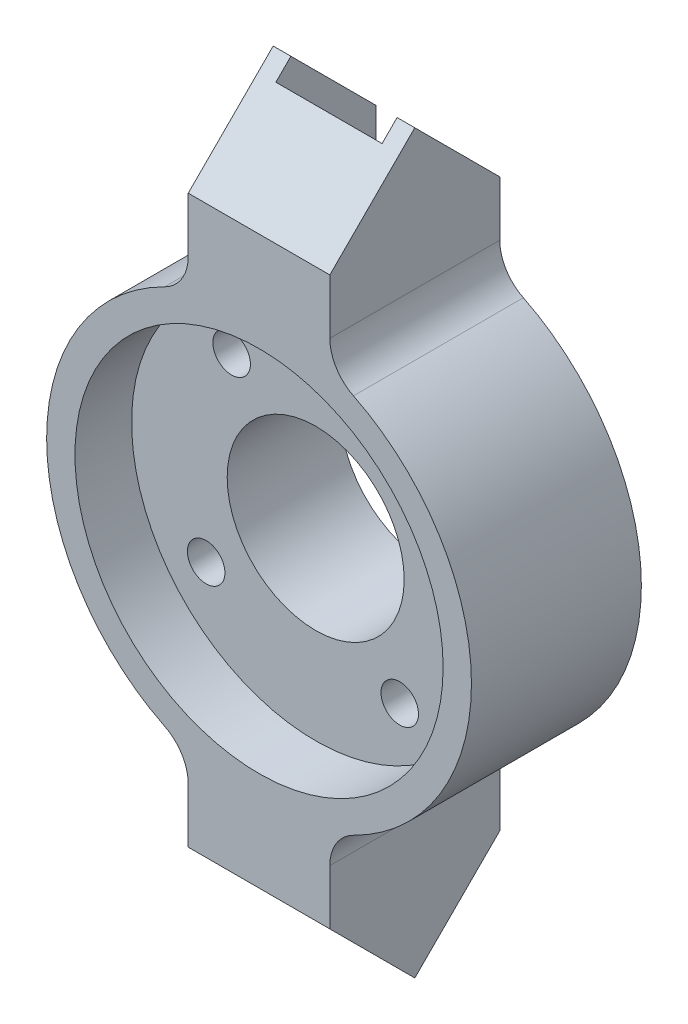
ISO-10303-21;
HEADER;
FILE_DESCRIPTION(('STEP AP214'),'2;1');
FILE_NAME('part.step','',(''),(''),'','','');
FILE_SCHEMA(('AUTOMOTIVE_DESIGN { 1 0 10303 214 1 1 1 1 }'));
ENDSEC;
DATA;
#1=APPLICATION_CONTEXT('core data for automotive mechanical design processes');
#2=APPLICATION_PROTOCOL_DEFINITION('international standard','automotive_design',2000,#1);
#3=PRODUCT_CONTEXT('',#1,'mechanical');
#4=PRODUCT('Part','Part','',(#3));
#5=PRODUCT_RELATED_PRODUCT_CATEGORY('part','',(#4));
#6=PRODUCT_DEFINITION_FORMATION('','',#4);
#7=PRODUCT_DEFINITION_CONTEXT('part definition',#1,'design');
#8=PRODUCT_DEFINITION('design','',#6,#7);
#9=PRODUCT_DEFINITION_SHAPE('','',#8);
#10=(LENGTH_UNIT() NAMED_UNIT(*) SI_UNIT(.MILLI.,.METRE.));
#11=(NAMED_UNIT(*) PLANE_ANGLE_UNIT() SI_UNIT($,.RADIAN.));
#12=(NAMED_UNIT(*) SI_UNIT($,.STERADIAN.) SOLID_ANGLE_UNIT());
#13=UNCERTAINTY_MEASURE_WITH_UNIT(LENGTH_MEASURE(1.E-05),#10,'distance_accuracy_value','');
#14=(GEOMETRIC_REPRESENTATION_CONTEXT(3) GLOBAL_UNCERTAINTY_ASSIGNED_CONTEXT((#13)) GLOBAL_UNIT_ASSIGNED_CONTEXT((#10,
#11,#12)) REPRESENTATION_CONTEXT('',''));
#15=CARTESIAN_POINT('',(0.,0.,0.));
#16=DIRECTION('',(0.,0.,1.));
#17=DIRECTION('',(1.,0.,0.));
#18=AXIS2_PLACEMENT_3D('',#15,#16,#17);
#19=CARTESIAN_POINT('',(0.,-40.,1.5));
#20=DIRECTION('',(0.,0.707106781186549,0.707106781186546));
#21=DIRECTION('',(0.,-0.707106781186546,0.707106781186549));
#22=AXIS2_PLACEMENT_3D('',#19,#20,#21);
#23=PLANE('',#22);
#24=DIRECTION('',(0.,-0.707106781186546,0.707106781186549));
#25=VECTOR('',#24,1.);
#26=CARTESIAN_POINT('',(-7.5,-40.,1.5));
#27=LINE('',#26,#25);
#28=CARTESIAN_POINT('',(-7.5,-51.9999999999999,13.4999999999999));
#29=VERTEX_POINT('',#28);
#30=CARTESIAN_POINT('',(-7.5,-40.,1.50000000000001));
#31=VERTEX_POINT('',#30);
#32=EDGE_CURVE('E401',#29,#31,#27,.F.);
#33=ORIENTED_EDGE('',*,*,#32,.F.);
#34=DIRECTION('',(-1.,0.,0.));
#35=VECTOR('',#34,1.);
#36=CARTESIAN_POINT('',(0.,-51.9999999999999,13.4999999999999));
#37=LINE('',#36,#35);
#38=CARTESIAN_POINT('',(-10.,-51.9999999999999,13.4999999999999));
#39=VERTEX_POINT('',#38);
#40=EDGE_CURVE('E428',#29,#39,#37,.T.);
#41=ORIENTED_EDGE('',*,*,#40,.T.);
#42=DIRECTION('',(0.,0.707106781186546,-0.707106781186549));
#43=VECTOR('',#42,1.);
#44=CARTESIAN_POINT('',(-10.,-59.5,21.));
#45=LINE('',#44,#43);
#46=CARTESIAN_POINT('',(-10.,-40.,1.5));
#47=VERTEX_POINT('',#46);
#48=EDGE_CURVE('E389',#47,#39,#45,.F.);
#49=ORIENTED_EDGE('',*,*,#48,.F.);
#50=DIRECTION('',(-1.,0.,0.));
#51=VECTOR('',#50,1.);
#52=CARTESIAN_POINT('',(0.,-40.,1.5));
#53=LINE('',#52,#51);
#54=EDGE_CURVE('E385',#31,#47,#53,.T.);
#55=ORIENTED_EDGE('',*,*,#54,.F.);
#56=EDGE_LOOP('',(#33,#41,#49,#55));
#57=FACE_BOUND('',#56,.T.);
#58=ADVANCED_FACE('F38',(#57),#23,.F.);
#59=CARTESIAN_POINT('',(0.,40.,1.5));
#60=DIRECTION('',(0.,-0.707106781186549,0.707106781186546));
#61=DIRECTION('',(0.,-0.707106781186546,-0.707106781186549));
#62=AXIS2_PLACEMENT_3D('',#59,#60,#61);
#63=PLANE('',#62);
#64=DIRECTION('',(0.,0.707106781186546,0.707106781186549));
#65=VECTOR('',#64,1.);
#66=CARTESIAN_POINT('',(7.5,40.,1.5));
#67=LINE('',#66,#65);
#68=CARTESIAN_POINT('',(7.5,51.9999999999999,13.4999999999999));
#69=VERTEX_POINT('',#68);
#70=CARTESIAN_POINT('',(7.5,40.,1.50000000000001));
#71=VERTEX_POINT('',#70);
#72=EDGE_CURVE('E396',#69,#71,#67,.F.);
#73=ORIENTED_EDGE('',*,*,#72,.F.);
#74=DIRECTION('',(1.,0.,0.));
#75=VECTOR('',#74,1.);
#76=CARTESIAN_POINT('',(0.,51.9999999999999,13.4999999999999));
#77=LINE('',#76,#75);
#78=CARTESIAN_POINT('',(10.,51.9999999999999,13.4999999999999));
#79=VERTEX_POINT('',#78);
#80=EDGE_CURVE('E411',#69,#79,#77,.T.);
#81=ORIENTED_EDGE('',*,*,#80,.T.);
#82=DIRECTION('',(0.,-0.707106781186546,-0.707106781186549));
#83=VECTOR('',#82,1.);
#84=CARTESIAN_POINT('',(10.,46.142135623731,7.642135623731));
#85=LINE('',#84,#83);
#86=CARTESIAN_POINT('',(10.,40.,1.5));
#87=VERTEX_POINT('',#86);
#88=EDGE_CURVE('E380',#87,#79,#85,.F.);
#89=ORIENTED_EDGE('',*,*,#88,.F.);
#90=DIRECTION('',(1.,0.,0.));
#91=VECTOR('',#90,1.);
#92=CARTESIAN_POINT('',(0.,40.,1.5));
#93=LINE('',#92,#91);
#94=EDGE_CURVE('E376',#71,#87,#93,.T.);
#95=ORIENTED_EDGE('',*,*,#94,.F.);
#96=EDGE_LOOP('',(#73,#81,#89,#95));
#97=FACE_BOUND('',#96,.T.);
#98=ADVANCED_FACE('F447',(#97),#63,.F.);
#99=CARTESIAN_POINT('',(0.,0.,25.5));
#100=DIRECTION('',(0.,0.,1.));
#101=DIRECTION('',(1.,0.,0.));
#102=AXIS2_PLACEMENT_3D('',#99,#100,#101);
#103=PLANE('',#102);
#104=CARTESIAN_POINT('',(0.,0.,25.5));
#105=DIRECTION('',(0.,0.,1.));
#106=DIRECTION('',(1.,0.,0.));
#107=AXIS2_PLACEMENT_3D('',#104,#105,#106);
#108=CIRCLE('',#107,26.);
#109=CARTESIAN_POINT('',(26.,0.,25.5));
#110=VERTEX_POINT('',#109);
#111=EDGE_CURVE('E312',#110,#110,#108,.T.);
#112=ORIENTED_EDGE('',*,*,#111,.F.);
#113=EDGE_LOOP('',(#112));
#114=FACE_BOUND('',#113,.T.);
#115=DIRECTION('',(0.,1.,0.));
#116=VECTOR('',#115,1.);
#117=CARTESIAN_POINT('',(-10.,-55.,25.5));
#118=LINE('',#117,#116);
#119=CARTESIAN_POINT('',(-10.,-39.9999999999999,25.5));
#120=VERTEX_POINT('',#119);
#121=CARTESIAN_POINT('',(-10.,-32.2490309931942,25.5));
#122=VERTEX_POINT('',#121);
#123=EDGE_CURVE('E251',#120,#122,#118,.T.);
#124=ORIENTED_EDGE('',*,*,#123,.F.);
#125=DIRECTION('',(1.,0.,0.));
#126=VECTOR('',#125,1.);
#127=CARTESIAN_POINT('',(0.,-39.9999999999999,25.5));
#128=LINE('',#127,#126);
#129=CARTESIAN_POINT('',(10.,-39.9999999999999,25.5));
#130=VERTEX_POINT('',#129);
#131=EDGE_CURVE('E431',#120,#130,#128,.T.);
#132=ORIENTED_EDGE('',*,*,#131,.T.);
#133=DIRECTION('',(0.,-1.,0.));
#134=VECTOR('',#133,1.);
#135=CARTESIAN_POINT('',(10.,-28.2842712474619,25.5));
#136=LINE('',#135,#134);
#137=CARTESIAN_POINT('',(10.,-32.2490309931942,25.5));
#138=VERTEX_POINT('',#137);
#139=EDGE_CURVE('E247',#138,#130,#136,.T.);
#140=ORIENTED_EDGE('',*,*,#139,.F.);
#141=CARTESIAN_POINT('',(16.,-32.2490309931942,25.5));
#142=DIRECTION('',(0.,0.,1.));
#143=DIRECTION('',(1.,0.,0.));
#144=AXIS2_PLACEMENT_3D('',#141,#142,#143);
#145=CIRCLE('',#144,6.);
#146=CARTESIAN_POINT('',(13.3333333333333,-26.8741924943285,25.5));
#147=VERTEX_POINT('',#146);
#148=EDGE_CURVE('E360',#138,#147,#145,.F.);
#149=ORIENTED_EDGE('',*,*,#148,.T.);
#150=CARTESIAN_POINT('',(0.,0.,25.5));
#151=DIRECTION('',(0.,0.,-1.));
#152=DIRECTION('',(-1.,0.,0.));
#153=AXIS2_PLACEMENT_3D('',#150,#151,#152);
#154=CIRCLE('',#153,30.);
#155=CARTESIAN_POINT('',(13.3333333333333,26.8741924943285,25.5));
#156=VERTEX_POINT('',#155);
#157=EDGE_CURVE('E244',#156,#147,#154,.T.);
#158=ORIENTED_EDGE('',*,*,#157,.F.);
#159=CARTESIAN_POINT('',(16.,32.2490309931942,25.5));
#160=DIRECTION('',(0.,0.,1.));
#161=DIRECTION('',(1.,0.,0.));
#162=AXIS2_PLACEMENT_3D('',#159,#160,#161);
#163=CIRCLE('',#162,6.);
#164=CARTESIAN_POINT('',(10.,32.2490309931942,25.5));
#165=VERTEX_POINT('',#164);
#166=EDGE_CURVE('E373',#156,#165,#163,.F.);
#167=ORIENTED_EDGE('',*,*,#166,.T.);
#168=DIRECTION('',(0.,-1.,0.));
#169=VECTOR('',#168,1.);
#170=CARTESIAN_POINT('',(10.,28.2842712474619,25.5));
#171=LINE('',#170,#169);
#172=CARTESIAN_POINT('',(10.,39.9999999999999,25.5));
#173=VERTEX_POINT('',#172);
#174=EDGE_CURVE('E259',#173,#165,#171,.T.);
#175=ORIENTED_EDGE('',*,*,#174,.F.);
#176=DIRECTION('',(-1.,0.,0.));
#177=VECTOR('',#176,1.);
#178=CARTESIAN_POINT('',(0.,39.9999999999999,25.5));
#179=LINE('',#178,#177);
#180=CARTESIAN_POINT('',(-10.,39.9999999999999,25.5));
#181=VERTEX_POINT('',#180);
#182=EDGE_CURVE('E415',#173,#181,#179,.T.);
#183=ORIENTED_EDGE('',*,*,#182,.T.);
#184=DIRECTION('',(0.,1.,0.));
#185=VECTOR('',#184,1.);
#186=CARTESIAN_POINT('',(-10.,55.,25.5));
#187=LINE('',#186,#185);
#188=CARTESIAN_POINT('',(-10.,32.2490309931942,25.5));
#189=VERTEX_POINT('',#188);
#190=EDGE_CURVE('E256',#189,#181,#187,.T.);
#191=ORIENTED_EDGE('',*,*,#190,.F.);
#192=CARTESIAN_POINT('',(-16.,32.2490309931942,25.5));
#193=DIRECTION('',(0.,0.,1.));
#194=DIRECTION('',(1.,0.,0.));
#195=AXIS2_PLACEMENT_3D('',#192,#193,#194);
#196=CIRCLE('',#195,6.);
#197=CARTESIAN_POINT('',(-13.3333333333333,26.8741924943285,25.5));
#198=VERTEX_POINT('',#197);
#199=EDGE_CURVE('E369',#189,#198,#196,.F.);
#200=ORIENTED_EDGE('',*,*,#199,.T.);
#201=CARTESIAN_POINT('',(0.,0.,25.5));
#202=DIRECTION('',(0.,0.,-1.));
#203=DIRECTION('',(-1.,0.,0.));
#204=AXIS2_PLACEMENT_3D('',#201,#202,#203);
#205=CIRCLE('',#204,30.);
#206=CARTESIAN_POINT('',(-13.3333333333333,-26.8741924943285,25.5));
#207=VERTEX_POINT('',#206);
#208=EDGE_CURVE('E253',#207,#198,#205,.T.);
#209=ORIENTED_EDGE('',*,*,#208,.F.);
#210=CARTESIAN_POINT('',(-16.,-32.2490309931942,25.5));
#211=DIRECTION('',(0.,0.,1.));
#212=DIRECTION('',(1.,0.,0.));
#213=AXIS2_PLACEMENT_3D('',#210,#211,#212);
#214=CIRCLE('',#213,6.);
#215=EDGE_CURVE('E364',#207,#122,#214,.F.);
#216=ORIENTED_EDGE('',*,*,#215,.T.);
#217=EDGE_LOOP('',(#124,#132,#140,#149,#158,#167,#175,#183,#191,#200,#209,#216));
#218=FACE_BOUND('',#217,.T.);
#219=ADVANCED_FACE('F454',(#114,#218),#103,.T.);
#220=CARTESIAN_POINT('',(0.,0.,1.5));
#221=DIRECTION('',(0.,0.,-1.));
#222=DIRECTION('',(-1.,0.,0.));
#223=AXIS2_PLACEMENT_3D('',#220,#221,#222);
#224=PLANE('',#223);
#225=DIRECTION('',(0.,1.,0.));
#226=VECTOR('',#225,1.);
#227=CARTESIAN_POINT('',(-7.5,0.,1.5));
#228=LINE('',#227,#226);
#229=CARTESIAN_POINT('',(-7.5,-35.7573593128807,1.50000000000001));
#230=VERTEX_POINT('',#229);
#231=EDGE_CURVE('E224',#31,#230,#228,.T.);
#232=ORIENTED_EDGE('',*,*,#231,.F.);
#233=ORIENTED_EDGE('',*,*,#54,.T.);
#234=DIRECTION('',(0.,1.,0.));
#235=VECTOR('',#234,1.);
#236=CARTESIAN_POINT('',(-10.,-55.,1.5));
#237=LINE('',#236,#235);
#238=CARTESIAN_POINT('',(-10.,-32.2490309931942,1.5));
#239=VERTEX_POINT('',#238);
#240=EDGE_CURVE('E267',#47,#239,#237,.T.);
#241=ORIENTED_EDGE('',*,*,#240,.T.);
#242=CARTESIAN_POINT('',(-16.,-32.2490309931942,1.5));
#243=DIRECTION('',(0.,0.,-1.));
#244=DIRECTION('',(-1.,0.,0.));
#245=AXIS2_PLACEMENT_3D('',#242,#243,#244);
#246=CIRCLE('',#245,6.);
#247=CARTESIAN_POINT('',(-13.3333333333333,-26.8741924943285,1.5));
#248=VERTEX_POINT('',#247);
#249=EDGE_CURVE('E362',#239,#248,#246,.F.);
#250=ORIENTED_EDGE('',*,*,#249,.T.);
#251=CARTESIAN_POINT('',(0.,0.,1.5));
#252=DIRECTION('',(0.,0.,-1.));
#253=DIRECTION('',(-1.,0.,0.));
#254=AXIS2_PLACEMENT_3D('',#251,#252,#253);
#255=CIRCLE('',#254,30.);
#256=CARTESIAN_POINT('',(-13.3333333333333,26.8741924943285,1.5));
#257=VERTEX_POINT('',#256);
#258=EDGE_CURVE('E269',#248,#257,#255,.T.);
#259=ORIENTED_EDGE('',*,*,#258,.T.);
#260=CARTESIAN_POINT('',(-16.,32.2490309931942,1.5));
#261=DIRECTION('',(0.,0.,-1.));
#262=DIRECTION('',(-1.,0.,0.));
#263=AXIS2_PLACEMENT_3D('',#260,#261,#262);
#264=CIRCLE('',#263,6.);
#265=CARTESIAN_POINT('',(-10.,32.2490309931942,1.5));
#266=VERTEX_POINT('',#265);
#267=EDGE_CURVE('E367',#257,#266,#264,.F.);
#268=ORIENTED_EDGE('',*,*,#267,.T.);
#269=DIRECTION('',(0.,1.,0.));
#270=VECTOR('',#269,1.);
#271=CARTESIAN_POINT('',(-10.,55.,1.5));
#272=LINE('',#271,#270);
#273=CARTESIAN_POINT('',(-10.,40.,1.5));
#274=VERTEX_POINT('',#273);
#275=EDGE_CURVE('E272',#266,#274,#272,.T.);
#276=ORIENTED_EDGE('',*,*,#275,.T.);
#277=CARTESIAN_POINT('',(-7.5,40.,1.5));
#278=VERTEX_POINT('',#277);
#279=EDGE_CURVE('E377',#274,#278,#93,.T.);
#280=ORIENTED_EDGE('',*,*,#279,.T.);
#281=DIRECTION('',(0.,1.,0.));
#282=VECTOR('',#281,1.);
#283=CARTESIAN_POINT('',(-7.5,0.,1.5));
#284=LINE('',#283,#282);
#285=CARTESIAN_POINT('',(-7.5,35.7573593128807,1.50000000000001));
#286=VERTEX_POINT('',#285);
#287=EDGE_CURVE('E235',#286,#278,#284,.T.);
#288=ORIENTED_EDGE('',*,*,#287,.F.);
#289=DIRECTION('',(1.,0.,0.));
#290=VECTOR('',#289,1.);
#291=CARTESIAN_POINT('',(0.,35.7573593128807,1.5));
#292=LINE('',#291,#290);
#293=CARTESIAN_POINT('',(7.5,35.7573593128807,1.50000000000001));
#294=VERTEX_POINT('',#293);
#295=EDGE_CURVE('E240',#286,#294,#292,.T.);
#296=ORIENTED_EDGE('',*,*,#295,.T.);
#297=DIRECTION('',(0.,-1.,0.));
#298=VECTOR('',#297,1.);
#299=CARTESIAN_POINT('',(7.5,0.,1.5));
#300=LINE('',#299,#298);
#301=EDGE_CURVE('E237',#71,#294,#300,.T.);
#302=ORIENTED_EDGE('',*,*,#301,.F.);
#303=ORIENTED_EDGE('',*,*,#94,.T.);
#304=DIRECTION('',(0.,-1.,0.));
#305=VECTOR('',#304,1.);
#306=CARTESIAN_POINT('',(10.,28.2842712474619,1.5));
#307=LINE('',#306,#305);
#308=CARTESIAN_POINT('',(10.,32.2490309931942,1.5));
#309=VERTEX_POINT('',#308);
#310=EDGE_CURVE('E248',#87,#309,#307,.T.);
#311=ORIENTED_EDGE('',*,*,#310,.T.);
#312=CARTESIAN_POINT('',(16.,32.2490309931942,1.5));
#313=DIRECTION('',(0.,0.,-1.));
#314=DIRECTION('',(-1.,0.,0.));
#315=AXIS2_PLACEMENT_3D('',#312,#313,#314);
#316=CIRCLE('',#315,6.);
#317=CARTESIAN_POINT('',(13.3333333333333,26.8741924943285,1.5));
#318=VERTEX_POINT('',#317);
#319=EDGE_CURVE('E371',#309,#318,#316,.F.);
#320=ORIENTED_EDGE('',*,*,#319,.T.);
#321=CARTESIAN_POINT('',(0.,0.,1.5));
#322=DIRECTION('',(0.,0.,-1.));
#323=DIRECTION('',(-1.,0.,0.));
#324=AXIS2_PLACEMENT_3D('',#321,#322,#323);
#325=CIRCLE('',#324,30.);
#326=CARTESIAN_POINT('',(13.3333333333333,-26.8741924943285,1.5));
#327=VERTEX_POINT('',#326);
#328=EDGE_CURVE('E243',#318,#327,#325,.T.);
#329=ORIENTED_EDGE('',*,*,#328,.T.);
#330=CARTESIAN_POINT('',(16.,-32.2490309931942,1.5));
#331=DIRECTION('',(0.,0.,-1.));
#332=DIRECTION('',(-1.,0.,0.));
#333=AXIS2_PLACEMENT_3D('',#330,#331,#332);
#334=CIRCLE('',#333,6.);
#335=CARTESIAN_POINT('',(10.,-32.2490309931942,1.5));
#336=VERTEX_POINT('',#335);
#337=EDGE_CURVE('E358',#327,#336,#334,.F.);
#338=ORIENTED_EDGE('',*,*,#337,.T.);
#339=DIRECTION('',(0.,-1.,0.));
#340=VECTOR('',#339,1.);
#341=CARTESIAN_POINT('',(10.,-28.2842712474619,1.5));
#342=LINE('',#341,#340);
#343=CARTESIAN_POINT('',(10.,-40.,1.5));
#344=VERTEX_POINT('',#343);
#345=EDGE_CURVE('E264',#336,#344,#342,.T.);
#346=ORIENTED_EDGE('',*,*,#345,.T.);
#347=CARTESIAN_POINT('',(7.5,-40.,1.5));
#348=VERTEX_POINT('',#347);
#349=EDGE_CURVE('E386',#344,#348,#53,.T.);
#350=ORIENTED_EDGE('',*,*,#349,.T.);
#351=DIRECTION('',(0.,-1.,0.));
#352=VECTOR('',#351,1.);
#353=CARTESIAN_POINT('',(7.5,0.,1.5));
#354=LINE('',#353,#352);
#355=CARTESIAN_POINT('',(7.5,-35.7573593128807,1.50000000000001));
#356=VERTEX_POINT('',#355);
#357=EDGE_CURVE('E222',#356,#348,#354,.T.);
#358=ORIENTED_EDGE('',*,*,#357,.F.);
#359=DIRECTION('',(-1.,0.,0.));
#360=VECTOR('',#359,1.);
#361=CARTESIAN_POINT('',(0.,-35.7573593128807,1.5));
#362=LINE('',#361,#360);
#363=EDGE_CURVE('E227',#356,#230,#362,.T.);
#364=ORIENTED_EDGE('',*,*,#363,.T.);
#365=EDGE_LOOP('',(#232,#233,#241,#250,#259,#268,#276,#280,#288,#296,#302,#303,#311,#320,#329,
#338,#346,#350,#358,#364));
#366=FACE_BOUND('',#365,.T.);
#367=CARTESIAN_POINT('',(0.,0.,1.5));
#368=DIRECTION('',(0.,0.,-1.));
#369=DIRECTION('',(-1.,0.,0.));
#370=AXIS2_PLACEMENT_3D('',#367,#368,#369);
#371=CIRCLE('',#370,12.5);
#372=CARTESIAN_POINT('',(-12.5,0.,1.5));
#373=VERTEX_POINT('',#372);
#374=EDGE_CURVE('E285',#373,#373,#371,.F.);
#375=ORIENTED_EDGE('',*,*,#374,.T.);
#376=EDGE_LOOP('',(#375));
#377=FACE_BOUND('',#376,.T.);
#378=CARTESIAN_POINT('',(-11.87084786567,15.4703901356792,1.5));
#379=DIRECTION('',(0.,0.,-1.));
#380=DIRECTION('',(-1.,0.,0.));
#381=AXIS2_PLACEMENT_3D('',#378,#379,#380);
#382=CIRCLE('',#381,5.);
#383=CARTESIAN_POINT('',(-16.87084786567,15.4703901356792,1.5));
#384=VERTEX_POINT('',#383);
#385=EDGE_CURVE('E279',#384,#384,#382,.F.);
#386=ORIENTED_EDGE('',*,*,#385,.T.);
#387=EDGE_LOOP('',(#386));
#388=FACE_BOUND('',#387,.T.);
#389=CARTESIAN_POINT('',(-15.4703901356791,-11.87084786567,1.5));
#390=DIRECTION('',(0.,0.,-1.));
#391=DIRECTION('',(-1.,0.,0.));
#392=AXIS2_PLACEMENT_3D('',#389,#390,#391);
#393=CIRCLE('',#392,5.);
#394=CARTESIAN_POINT('',(-20.4703901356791,-11.87084786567,1.5));
#395=VERTEX_POINT('',#394);
#396=EDGE_CURVE('E261',#395,#395,#393,.F.);
#397=ORIENTED_EDGE('',*,*,#396,.T.);
#398=EDGE_LOOP('',(#397));
#399=FACE_BOUND('',#398,.T.);
#400=CARTESIAN_POINT('',(11.8708478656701,-15.4703901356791,1.5));
#401=DIRECTION('',(0.,0.,-1.));
#402=DIRECTION('',(-1.,0.,0.));
#403=AXIS2_PLACEMENT_3D('',#400,#401,#402);
#404=CIRCLE('',#403,5.);
#405=CARTESIAN_POINT('',(6.87084786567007,-15.4703901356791,1.5));
#406=VERTEX_POINT('',#405);
#407=EDGE_CURVE('E276',#406,#406,#404,.F.);
#408=ORIENTED_EDGE('',*,*,#407,.T.);
#409=EDGE_LOOP('',(#408));
#410=FACE_BOUND('',#409,.T.);
#411=CARTESIAN_POINT('',(15.470390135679,11.8708478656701,1.5));
#412=DIRECTION('',(0.,0.,-1.));
#413=DIRECTION('',(-1.,0.,0.));
#414=AXIS2_PLACEMENT_3D('',#411,#412,#413);
#415=CIRCLE('',#414,5.);
#416=CARTESIAN_POINT('',(10.470390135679,11.8708478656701,1.5));
#417=VERTEX_POINT('',#416);
#418=EDGE_CURVE('E282',#417,#417,#415,.F.);
#419=ORIENTED_EDGE('',*,*,#418,.T.);
#420=EDGE_LOOP('',(#419));
#421=FACE_BOUND('',#420,.T.);
#422=ADVANCED_FACE('F490',(#366,#377,#388,#399,#410,#421),#224,.T.);
#423=CARTESIAN_POINT('',(0.,0.,25.5));
#424=DIRECTION('',(0.,0.,-1.));
#425=DIRECTION('',(-1.,0.,0.));
#426=AXIS2_PLACEMENT_3D('',#423,#424,#425);
#427=CYLINDRICAL_SURFACE('',#426,12.5);
#428=CARTESIAN_POINT('',(0.,0.,17.5));
#429=DIRECTION('',(0.,0.,1.));
#430=DIRECTION('',(1.,0.,0.));
#431=AXIS2_PLACEMENT_3D('',#428,#429,#430);
#432=CIRCLE('',#431,12.5);
#433=CARTESIAN_POINT('',(12.5,0.,17.5));
#434=VERTEX_POINT('',#433);
#435=EDGE_CURVE('E307',#434,#434,#432,.T.);
#436=ORIENTED_EDGE('',*,*,#435,.T.);
#437=EDGE_LOOP('',(#436));
#438=FACE_BOUND('',#437,.T.);
#439=ORIENTED_EDGE('',*,*,#374,.F.);
#440=EDGE_LOOP('',(#439));
#441=FACE_BOUND('',#440,.T.);
#442=ADVANCED_FACE('F562',(#438,#441),#427,.F.);
#443=CARTESIAN_POINT('',(15.470390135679,11.8708478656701,5.));
#444=DIRECTION('',(0.,0.,-1.));
#445=DIRECTION('',(-1.,0.,0.));
#446=AXIS2_PLACEMENT_3D('',#443,#444,#445);
#447=CYLINDRICAL_SURFACE('',#446,5.);
#448=CARTESIAN_POINT('',(15.470390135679,11.8708478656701,5.));
#449=DIRECTION('',(0.,0.,-1.));
#450=DIRECTION('',(-1.,0.,0.));
#451=AXIS2_PLACEMENT_3D('',#448,#449,#450);
#452=CIRCLE('',#451,5.);
#453=CARTESIAN_POINT('',(10.470390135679,11.8708478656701,5.));
#454=VERTEX_POINT('',#453);
#455=EDGE_CURVE('E300',#454,#454,#452,.T.);
#456=ORIENTED_EDGE('',*,*,#455,.F.);
#457=EDGE_LOOP('',(#456));
#458=FACE_BOUND('',#457,.T.);
#459=ORIENTED_EDGE('',*,*,#418,.F.);
#460=EDGE_LOOP('',(#459));
#461=FACE_BOUND('',#460,.T.);
#462=ADVANCED_FACE('F587',(#458,#461),#447,.F.);
#463=CARTESIAN_POINT('',(-11.87084786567,15.4703901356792,5.));
#464=DIRECTION('',(0.,0.,-1.));
#465=DIRECTION('',(-1.,0.,0.));
#466=AXIS2_PLACEMENT_3D('',#463,#464,#465);
#467=CYLINDRICAL_SURFACE('',#466,5.);
#468=CARTESIAN_POINT('',(-11.87084786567,15.4703901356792,5.));
#469=DIRECTION('',(0.,0.,-1.));
#470=DIRECTION('',(-1.,0.,0.));
#471=AXIS2_PLACEMENT_3D('',#468,#469,#470);
#472=CIRCLE('',#471,5.);
#473=CARTESIAN_POINT('',(-16.87084786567,15.4703901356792,5.));
#474=VERTEX_POINT('',#473);
#475=EDGE_CURVE('E296',#474,#474,#472,.T.);
#476=ORIENTED_EDGE('',*,*,#475,.F.);
#477=EDGE_LOOP('',(#476));
#478=FACE_BOUND('',#477,.T.);
#479=ORIENTED_EDGE('',*,*,#385,.F.);
#480=EDGE_LOOP('',(#479));
#481=FACE_BOUND('',#480,.T.);
#482=ADVANCED_FACE('F579',(#478,#481),#467,.F.);
#483=CARTESIAN_POINT('',(11.8708478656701,-15.4703901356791,5.));
#484=DIRECTION('',(0.,0.,-1.));
#485=DIRECTION('',(-1.,0.,0.));
#486=AXIS2_PLACEMENT_3D('',#483,#484,#485);
#487=CYLINDRICAL_SURFACE('',#486,5.);
#488=CARTESIAN_POINT('',(11.8708478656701,-15.4703901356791,5.));
#489=DIRECTION('',(0.,0.,-1.));
#490=DIRECTION('',(-1.,0.,0.));
#491=AXIS2_PLACEMENT_3D('',#488,#489,#490);
#492=CIRCLE('',#491,5.);
#493=CARTESIAN_POINT('',(6.87084786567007,-15.4703901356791,5.));
#494=VERTEX_POINT('',#493);
#495=EDGE_CURVE('E292',#494,#494,#492,.T.);
#496=ORIENTED_EDGE('',*,*,#495,.F.);
#497=EDGE_LOOP('',(#496));
#498=FACE_BOUND('',#497,.T.);
#499=ORIENTED_EDGE('',*,*,#407,.F.);
#500=EDGE_LOOP('',(#499));
#501=FACE_BOUND('',#500,.T.);
#502=ADVANCED_FACE('F571',(#498,#501),#487,.F.);
#503=CARTESIAN_POINT('',(-15.4703901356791,-11.87084786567,5.));
#504=DIRECTION('',(0.,0.,-1.));
#505=DIRECTION('',(-1.,0.,0.));
#506=AXIS2_PLACEMENT_3D('',#503,#504,#505);
#507=CYLINDRICAL_SURFACE('',#506,5.);
#508=CARTESIAN_POINT('',(-15.4703901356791,-11.87084786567,5.));
#509=DIRECTION('',(0.,0.,-1.));
#510=DIRECTION('',(-1.,0.,0.));
#511=AXIS2_PLACEMENT_3D('',#508,#509,#510);
#512=CIRCLE('',#511,5.);
#513=CARTESIAN_POINT('',(-20.4703901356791,-11.87084786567,5.));
#514=VERTEX_POINT('',#513);
#515=EDGE_CURVE('E288',#514,#514,#512,.T.);
#516=ORIENTED_EDGE('',*,*,#515,.F.);
#517=EDGE_LOOP('',(#516));
#518=FACE_BOUND('',#517,.T.);
#519=ORIENTED_EDGE('',*,*,#396,.F.);
#520=EDGE_LOOP('',(#519));
#521=FACE_BOUND('',#520,.T.);
#522=ADVANCED_FACE('F567',(#518,#521),#507,.F.);
#523=CARTESIAN_POINT('',(-15.4703901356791,-11.87084786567,0.));
#524=DIRECTION('',(0.,0.,-1.));
#525=DIRECTION('',(-1.,0.,0.));
#526=AXIS2_PLACEMENT_3D('',#523,#524,#525);
#527=CYLINDRICAL_SURFACE('',#526,2.64999999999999);
#528=CARTESIAN_POINT('',(-15.4703901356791,-11.87084786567,17.5));
#529=DIRECTION('',(0.,0.,1.));
#530=DIRECTION('',(1.,0.,0.));
#531=AXIS2_PLACEMENT_3D('',#528,#529,#530);
#532=CIRCLE('',#531,2.64999999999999);
#533=CARTESIAN_POINT('',(-12.8203901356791,-11.87084786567,17.5));
#534=VERTEX_POINT('',#533);
#535=EDGE_CURVE('E308',#534,#534,#532,.T.);
#536=ORIENTED_EDGE('',*,*,#535,.T.);
#537=EDGE_LOOP('',(#536));
#538=FACE_BOUND('',#537,.T.);
#539=CARTESIAN_POINT('',(-15.4703901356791,-11.87084786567,5.));
#540=DIRECTION('',(0.,0.,-1.));
#541=DIRECTION('',(-1.,0.,0.));
#542=AXIS2_PLACEMENT_3D('',#539,#540,#541);
#543=CIRCLE('',#542,2.64999999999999);
#544=CARTESIAN_POINT('',(-18.1203901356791,-11.87084786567,5.));
#545=VERTEX_POINT('',#544);
#546=EDGE_CURVE('E291',#545,#545,#543,.F.);
#547=ORIENTED_EDGE('',*,*,#546,.F.);
#548=EDGE_LOOP('',(#547));
#549=FACE_BOUND('',#548,.T.);
#550=ADVANCED_FACE('F570',(#538,#549),#527,.F.);
#551=CARTESIAN_POINT('',(11.8708478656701,-15.4703901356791,0.));
#552=DIRECTION('',(0.,0.,-1.));
#553=DIRECTION('',(-1.,0.,0.));
#554=AXIS2_PLACEMENT_3D('',#551,#552,#553);
#555=CYLINDRICAL_SURFACE('',#554,2.64999999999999);
#556=CARTESIAN_POINT('',(11.8708478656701,-15.4703901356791,17.5));
#557=DIRECTION('',(0.,0.,1.));
#558=DIRECTION('',(1.,0.,0.));
#559=AXIS2_PLACEMENT_3D('',#556,#557,#558);
#560=CIRCLE('',#559,2.64999999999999);
#561=CARTESIAN_POINT('',(14.5208478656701,-15.4703901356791,17.5));
#562=VERTEX_POINT('',#561);
#563=EDGE_CURVE('E323',#562,#562,#560,.T.);
#564=ORIENTED_EDGE('',*,*,#563,.T.);
#565=EDGE_LOOP('',(#564));
#566=FACE_BOUND('',#565,.T.);
#567=CARTESIAN_POINT('',(11.8708478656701,-15.4703901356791,5.));
#568=DIRECTION('',(0.,0.,-1.));
#569=DIRECTION('',(-1.,0.,0.));
#570=AXIS2_PLACEMENT_3D('',#567,#568,#569);
#571=CIRCLE('',#570,2.64999999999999);
#572=CARTESIAN_POINT('',(9.22084786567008,-15.4703901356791,5.));
#573=VERTEX_POINT('',#572);
#574=EDGE_CURVE('E295',#573,#573,#571,.F.);
#575=ORIENTED_EDGE('',*,*,#574,.F.);
#576=EDGE_LOOP('',(#575));
#577=FACE_BOUND('',#576,.T.);
#578=ADVANCED_FACE('F601',(#566,#577),#555,.F.);
#579=CARTESIAN_POINT('',(-11.87084786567,15.4703901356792,0.));
#580=DIRECTION('',(0.,0.,-1.));
#581=DIRECTION('',(-1.,0.,0.));
#582=AXIS2_PLACEMENT_3D('',#579,#580,#581);
#583=CYLINDRICAL_SURFACE('',#582,2.64999999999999);
#584=CARTESIAN_POINT('',(-11.87084786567,15.4703901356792,17.5));
#585=DIRECTION('',(0.,0.,1.));
#586=DIRECTION('',(1.,0.,0.));
#587=AXIS2_PLACEMENT_3D('',#584,#585,#586);
#588=CIRCLE('',#587,2.64999999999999);
#589=CARTESIAN_POINT('',(-9.22084786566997,15.4703901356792,17.5));
#590=VERTEX_POINT('',#589);
#591=EDGE_CURVE('E304',#590,#590,#588,.T.);
#592=ORIENTED_EDGE('',*,*,#591,.T.);
#593=EDGE_LOOP('',(#592));
#594=FACE_BOUND('',#593,.T.);
#595=CARTESIAN_POINT('',(-11.87084786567,15.4703901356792,5.));
#596=DIRECTION('',(0.,0.,-1.));
#597=DIRECTION('',(-1.,0.,0.));
#598=AXIS2_PLACEMENT_3D('',#595,#596,#597);
#599=CIRCLE('',#598,2.64999999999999);
#600=CARTESIAN_POINT('',(-14.5208478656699,15.4703901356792,5.));
#601=VERTEX_POINT('',#600);
#602=EDGE_CURVE('E299',#601,#601,#599,.F.);
#603=ORIENTED_EDGE('',*,*,#602,.F.);
#604=EDGE_LOOP('',(#603));
#605=FACE_BOUND('',#604,.T.);
#606=ADVANCED_FACE('F599',(#594,#605),#583,.F.);
#607=CARTESIAN_POINT('',(15.470390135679,11.8708478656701,0.));
#608=DIRECTION('',(0.,0.,-1.));
#609=DIRECTION('',(-1.,0.,0.));
#610=AXIS2_PLACEMENT_3D('',#607,#608,#609);
#611=CYLINDRICAL_SURFACE('',#610,2.64999999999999);
#612=CARTESIAN_POINT('',(15.470390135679,11.8708478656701,17.5));
#613=DIRECTION('',(0.,0.,1.));
#614=DIRECTION('',(1.,0.,0.));
#615=AXIS2_PLACEMENT_3D('',#612,#613,#614);
#616=CIRCLE('',#615,2.64999999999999);
#617=CARTESIAN_POINT('',(18.120390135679,11.8708478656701,17.5));
#618=VERTEX_POINT('',#617);
#619=EDGE_CURVE('E326',#618,#618,#616,.T.);
#620=ORIENTED_EDGE('',*,*,#619,.T.);
#621=EDGE_LOOP('',(#620));
#622=FACE_BOUND('',#621,.T.);
#623=CARTESIAN_POINT('',(15.470390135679,11.8708478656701,5.));
#624=DIRECTION('',(0.,0.,-1.));
#625=DIRECTION('',(-1.,0.,0.));
#626=AXIS2_PLACEMENT_3D('',#623,#624,#625);
#627=CIRCLE('',#626,2.64999999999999);
#628=CARTESIAN_POINT('',(12.820390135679,11.8708478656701,5.));
#629=VERTEX_POINT('',#628);
#630=EDGE_CURVE('E303',#629,#629,#627,.F.);
#631=ORIENTED_EDGE('',*,*,#630,.F.);
#632=EDGE_LOOP('',(#631));
#633=FACE_BOUND('',#632,.T.);
#634=ADVANCED_FACE('F595',(#622,#633),#611,.F.);
#635=CARTESIAN_POINT('',(0.,0.,17.5));
#636=DIRECTION('',(0.,0.,1.));
#637=DIRECTION('',(1.,0.,0.));
#638=AXIS2_PLACEMENT_3D('',#635,#636,#637);
#639=CYLINDRICAL_SURFACE('',#638,26.);
#640=CARTESIAN_POINT('',(0.,0.,17.5));
#641=DIRECTION('',(0.,0.,1.));
#642=DIRECTION('',(1.,0.,0.));
#643=AXIS2_PLACEMENT_3D('',#640,#641,#642);
#644=CIRCLE('',#643,26.);
#645=CARTESIAN_POINT('',(26.,0.,17.5));
#646=VERTEX_POINT('',#645);
#647=EDGE_CURVE('E313',#646,#646,#644,.T.);
#648=ORIENTED_EDGE('',*,*,#647,.F.);
#649=EDGE_LOOP('',(#648));
#650=FACE_BOUND('',#649,.T.);
#651=ORIENTED_EDGE('',*,*,#111,.T.);
#652=EDGE_LOOP('',(#651));
#653=FACE_BOUND('',#652,.T.);
#654=ADVANCED_FACE('F598',(#650,#653),#639,.F.);
#655=CARTESIAN_POINT('',(0.,0.,17.5));
#656=DIRECTION('',(0.,0.,1.));
#657=DIRECTION('',(1.,0.,0.));
#658=AXIS2_PLACEMENT_3D('',#655,#656,#657);
#659=PLANE('',#658);
#660=CARTESIAN_POINT('',(19.5,0.,17.5));
#661=DIRECTION('',(0.,0.,1.));
#662=DIRECTION('',(1.,0.,0.));
#663=AXIS2_PLACEMENT_3D('',#660,#661,#662);
#664=CIRCLE('',#663,2.50000000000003);
#665=CARTESIAN_POINT('',(22.,0.,17.5));
#666=VERTEX_POINT('',#665);
#667=EDGE_CURVE('E12',#666,#666,#664,.F.);
#668=ORIENTED_EDGE('',*,*,#667,.T.);
#669=EDGE_LOOP('',(#668));
#670=FACE_BOUND('',#669,.T.);
#671=ORIENTED_EDGE('',*,*,#619,.F.);
#672=EDGE_LOOP('',(#671));
#673=FACE_BOUND('',#672,.T.);
#674=ORIENTED_EDGE('',*,*,#563,.F.);
#675=EDGE_LOOP('',(#674));
#676=FACE_BOUND('',#675,.T.);
#677=ORIENTED_EDGE('',*,*,#535,.F.);
#678=EDGE_LOOP('',(#677));
#679=FACE_BOUND('',#678,.T.);
#680=ORIENTED_EDGE('',*,*,#591,.F.);
#681=EDGE_LOOP('',(#680));
#682=FACE_BOUND('',#681,.T.);
#683=ORIENTED_EDGE('',*,*,#435,.F.);
#684=EDGE_LOOP('',(#683));
#685=FACE_BOUND('',#684,.T.);
#686=ORIENTED_EDGE('',*,*,#647,.T.);
#687=EDGE_LOOP('',(#686));
#688=FACE_BOUND('',#687,.T.);
#689=ADVANCED_FACE('F619',(#670,#673,#676,#679,#682,#685,#688),#659,.T.);
#690=CARTESIAN_POINT('',(19.5,0.,7.5));
#691=DIRECTION('',(0.,0.,1.));
#692=DIRECTION('',(1.,0.,0.));
#693=AXIS2_PLACEMENT_3D('',#690,#691,#692);
#694=CONICAL_SURFACE('',#693,1.99999999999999,1.02974425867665);
#695=CARTESIAN_POINT('',(19.5,0.,6.29827876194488));
#696=VERTEX_POINT('',#695);
#697=VERTEX_LOOP('',#696);
#698=FACE_BOUND('',#697,.T.);
#699=CARTESIAN_POINT('',(19.5,0.,7.5));
#700=DIRECTION('',(0.,0.,1.));
#701=DIRECTION('',(1.,0.,0.));
#702=AXIS2_PLACEMENT_3D('',#699,#700,#701);
#703=CIRCLE('',#702,1.99999999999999);
#704=CARTESIAN_POINT('',(21.5,0.,7.5));
#705=VERTEX_POINT('',#704);
#706=EDGE_CURVE('E309',#705,#705,#703,.T.);
#707=ORIENTED_EDGE('',*,*,#706,.T.);
#708=EDGE_LOOP('',(#707));
#709=FACE_BOUND('',#708,.T.);
#710=ADVANCED_FACE('F616',(#698,#709),#694,.F.);
#711=CARTESIAN_POINT('',(19.5,0.,17.5));
#712=DIRECTION('',(0.,0.,1.));
#713=DIRECTION('',(1.,0.,0.));
#714=AXIS2_PLACEMENT_3D('',#711,#712,#713);
#715=CYLINDRICAL_SURFACE('',#714,1.99999999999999);
#716=CARTESIAN_POINT('',(19.5,0.,17.));
#717=DIRECTION('',(0.,0.,1.));
#718=DIRECTION('',(1.,0.,0.));
#719=AXIS2_PLACEMENT_3D('',#716,#717,#718);
#720=CIRCLE('',#719,1.99999999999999);
#721=CARTESIAN_POINT('',(21.5,0.,17.));
#722=VERTEX_POINT('',#721);
#723=EDGE_CURVE('E46',#722,#722,#720,.T.);
#724=ORIENTED_EDGE('',*,*,#723,.T.);
#725=EDGE_LOOP('',(#724));
#726=FACE_BOUND('',#725,.T.);
#727=ORIENTED_EDGE('',*,*,#706,.F.);
#728=EDGE_LOOP('',(#727));
#729=FACE_BOUND('',#728,.T.);
#730=ADVANCED_FACE('F436',(#726,#729),#715,.F.);
#731=CARTESIAN_POINT('',(15.470390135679,11.8708478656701,5.));
#732=DIRECTION('',(0.,0.,-1.));
#733=DIRECTION('',(-1.,0.,0.));
#734=AXIS2_PLACEMENT_3D('',#731,#732,#733);
#735=PLANE('',#734);
#736=ORIENTED_EDGE('',*,*,#455,.T.);
#737=EDGE_LOOP('',(#736));
#738=FACE_BOUND('',#737,.T.);
#739=ORIENTED_EDGE('',*,*,#630,.T.);
#740=EDGE_LOOP('',(#739));
#741=FACE_BOUND('',#740,.T.);
#742=ADVANCED_FACE('F583',(#738,#741),#735,.T.);
#743=CARTESIAN_POINT('',(-11.87084786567,15.4703901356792,5.));
#744=DIRECTION('',(0.,0.,-1.));
#745=DIRECTION('',(-1.,0.,0.));
#746=AXIS2_PLACEMENT_3D('',#743,#744,#745);
#747=PLANE('',#746);
#748=ORIENTED_EDGE('',*,*,#475,.T.);
#749=EDGE_LOOP('',(#748));
#750=FACE_BOUND('',#749,.T.);
#751=ORIENTED_EDGE('',*,*,#602,.T.);
#752=EDGE_LOOP('',(#751));
#753=FACE_BOUND('',#752,.T.);
#754=ADVANCED_FACE('F575',(#750,#753),#747,.T.);
#755=CARTESIAN_POINT('',(11.8708478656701,-15.4703901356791,5.));
#756=DIRECTION('',(0.,0.,-1.));
#757=DIRECTION('',(-1.,0.,0.));
#758=AXIS2_PLACEMENT_3D('',#755,#756,#757);
#759=PLANE('',#758);
#760=ORIENTED_EDGE('',*,*,#495,.T.);
#761=EDGE_LOOP('',(#760));
#762=FACE_BOUND('',#761,.T.);
#763=ORIENTED_EDGE('',*,*,#574,.T.);
#764=EDGE_LOOP('',(#763));
#765=FACE_BOUND('',#764,.T.);
#766=ADVANCED_FACE('F565',(#762,#765),#759,.T.);
#767=CARTESIAN_POINT('',(-15.4703901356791,-11.87084786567,5.));
#768=DIRECTION('',(0.,0.,-1.));
#769=DIRECTION('',(-1.,0.,0.));
#770=AXIS2_PLACEMENT_3D('',#767,#768,#769);
#771=PLANE('',#770);
#772=ORIENTED_EDGE('',*,*,#515,.T.);
#773=EDGE_LOOP('',(#772));
#774=FACE_BOUND('',#773,.T.);
#775=ORIENTED_EDGE('',*,*,#546,.T.);
#776=EDGE_LOOP('',(#775));
#777=FACE_BOUND('',#776,.T.);
#778=ADVANCED_FACE('F559',(#774,#777),#771,.T.);
#779=CARTESIAN_POINT('',(0.,0.,25.5));
#780=DIRECTION('',(0.,0.,-1.));
#781=DIRECTION('',(-1.,0.,0.));
#782=AXIS2_PLACEMENT_3D('',#779,#780,#781);
#783=CYLINDRICAL_SURFACE('',#782,30.);
#784=ORIENTED_EDGE('',*,*,#157,.T.);
#785=DIRECTION('',(0.,0.,-1.));
#786=VECTOR('',#785,1.);
#787=CARTESIAN_POINT('',(13.3333333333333,-26.8741924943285,25.5));
#788=LINE('',#787,#786);
#789=EDGE_CURVE('E340',#147,#327,#788,.T.);
#790=ORIENTED_EDGE('',*,*,#789,.T.);
#791=ORIENTED_EDGE('',*,*,#328,.F.);
#792=DIRECTION('',(0.,0.,-1.));
#793=VECTOR('',#792,1.);
#794=CARTESIAN_POINT('',(13.3333333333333,26.8741924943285,25.5));
#795=LINE('',#794,#793);
#796=EDGE_CURVE('E316',#318,#156,#795,.F.);
#797=ORIENTED_EDGE('',*,*,#796,.T.);
#798=EDGE_LOOP('',(#784,#790,#791,#797));
#799=FACE_BOUND('',#798,.T.);
#800=ADVANCED_FACE('F504',(#799),#783,.T.);
#801=CARTESIAN_POINT('',(10.,28.2842712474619,25.5));
#802=DIRECTION('',(1.,0.,0.));
#803=DIRECTION('',(0.,0.,-1.));
#804=AXIS2_PLACEMENT_3D('',#801,#802,#803);
#805=PLANE('',#804);
#806=ORIENTED_EDGE('',*,*,#88,.T.);
#807=DIRECTION('',(0.,0.707106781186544,-0.707106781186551));
#808=VECTOR('',#807,1.);
#809=CARTESIAN_POINT('',(10.,34.142135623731,31.357864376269));
#810=LINE('',#809,#808);
#811=EDGE_CURVE('E413',#79,#173,#810,.F.);
#812=ORIENTED_EDGE('',*,*,#811,.T.);
#813=ORIENTED_EDGE('',*,*,#174,.T.);
#814=DIRECTION('',(0.,0.,1.));
#815=VECTOR('',#814,1.);
#816=CARTESIAN_POINT('',(10.,32.2490309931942,1.5));
#817=LINE('',#816,#815);
#818=EDGE_CURVE('E355',#165,#309,#817,.F.);
#819=ORIENTED_EDGE('',*,*,#818,.T.);
#820=ORIENTED_EDGE('',*,*,#310,.F.);
#821=EDGE_LOOP('',(#806,#812,#813,#819,#820));
#822=FACE_BOUND('',#821,.T.);
#823=ADVANCED_FACE('F558',(#822),#805,.T.);
#824=CARTESIAN_POINT('',(-10.,55.,25.5));
#825=DIRECTION('',(-1.,0.,0.));
#826=DIRECTION('',(0.,-1.,0.));
#827=AXIS2_PLACEMENT_3D('',#824,#825,#826);
#828=PLANE('',#827);
#829=ORIENTED_EDGE('',*,*,#190,.T.);
#830=DIRECTION('',(0.,-0.707106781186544,0.707106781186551));
#831=VECTOR('',#830,1.);
#832=CARTESIAN_POINT('',(-10.,47.4999999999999,17.9999999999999));
#833=LINE('',#832,#831);
#834=CARTESIAN_POINT('',(-10.,51.9999999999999,13.4999999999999));
#835=VERTEX_POINT('',#834);
#836=EDGE_CURVE('E418',#181,#835,#833,.F.);
#837=ORIENTED_EDGE('',*,*,#836,.T.);
#838=DIRECTION('',(0.,0.707106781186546,0.707106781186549));
#839=VECTOR('',#838,1.);
#840=CARTESIAN_POINT('',(-10.,59.5,21.));
#841=LINE('',#840,#839);
#842=EDGE_CURVE('E383',#835,#274,#841,.F.);
#843=ORIENTED_EDGE('',*,*,#842,.T.);
#844=ORIENTED_EDGE('',*,*,#275,.F.);
#845=DIRECTION('',(0.,0.,1.));
#846=VECTOR('',#845,1.);
#847=CARTESIAN_POINT('',(-10.,32.2490309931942,25.5));
#848=LINE('',#847,#846);
#849=EDGE_CURVE('E353',#266,#189,#848,.T.);
#850=ORIENTED_EDGE('',*,*,#849,.T.);
#851=EDGE_LOOP('',(#829,#837,#843,#844,#850));
#852=FACE_BOUND('',#851,.T.);
#853=ADVANCED_FACE('F522',(#852),#828,.T.);
#854=CARTESIAN_POINT('',(0.,0.,25.5));
#855=DIRECTION('',(0.,0.,-1.));
#856=DIRECTION('',(-1.,0.,0.));
#857=AXIS2_PLACEMENT_3D('',#854,#855,#856);
#858=CYLINDRICAL_SURFACE('',#857,30.);
#859=ORIENTED_EDGE('',*,*,#258,.F.);
#860=DIRECTION('',(0.,0.,-1.));
#861=VECTOR('',#860,1.);
#862=CARTESIAN_POINT('',(-13.3333333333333,-26.8741924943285,25.5));
#863=LINE('',#862,#861);
#864=EDGE_CURVE('E351',#248,#207,#863,.F.);
#865=ORIENTED_EDGE('',*,*,#864,.T.);
#866=ORIENTED_EDGE('',*,*,#208,.T.);
#867=DIRECTION('',(0.,0.,-1.));
#868=VECTOR('',#867,1.);
#869=CARTESIAN_POINT('',(-13.3333333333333,26.8741924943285,25.5));
#870=LINE('',#869,#868);
#871=EDGE_CURVE('E348',#198,#257,#870,.T.);
#872=ORIENTED_EDGE('',*,*,#871,.T.);
#873=EDGE_LOOP('',(#859,#865,#866,#872));
#874=FACE_BOUND('',#873,.T.);
#875=ADVANCED_FACE('F536',(#874),#858,.T.);
#876=CARTESIAN_POINT('',(-10.,-55.,25.5));
#877=DIRECTION('',(-1.,0.,0.));
#878=DIRECTION('',(0.,0.,1.));
#879=AXIS2_PLACEMENT_3D('',#876,#877,#878);
#880=PLANE('',#879);
#881=ORIENTED_EDGE('',*,*,#48,.T.);
#882=DIRECTION('',(0.,-0.707106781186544,-0.707106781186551));
#883=VECTOR('',#882,1.);
#884=CARTESIAN_POINT('',(-10.,-47.4999999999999,17.9999999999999));
#885=LINE('',#884,#883);
#886=EDGE_CURVE('E61',#39,#120,#885,.F.);
#887=ORIENTED_EDGE('',*,*,#886,.T.);
#888=ORIENTED_EDGE('',*,*,#123,.T.);
#889=DIRECTION('',(0.,0.,1.));
#890=VECTOR('',#889,1.);
#891=CARTESIAN_POINT('',(-10.,-32.2490309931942,1.5));
#892=LINE('',#891,#890);
#893=EDGE_CURVE('E345',#122,#239,#892,.F.);
#894=ORIENTED_EDGE('',*,*,#893,.T.);
#895=ORIENTED_EDGE('',*,*,#240,.F.);
#896=EDGE_LOOP('',(#881,#887,#888,#894,#895));
#897=FACE_BOUND('',#896,.T.);
#898=ADVANCED_FACE('F545',(#897),#880,.T.);
#899=CARTESIAN_POINT('',(10.,-28.2842712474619,25.5));
#900=DIRECTION('',(1.,0.,0.));
#901=DIRECTION('',(0.,1.,0.));
#902=AXIS2_PLACEMENT_3D('',#899,#900,#901);
#903=PLANE('',#902);
#904=ORIENTED_EDGE('',*,*,#139,.T.);
#905=DIRECTION('',(0.,0.707106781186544,0.707106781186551));
#906=VECTOR('',#905,1.);
#907=CARTESIAN_POINT('',(10.,-34.142135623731,31.357864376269));
#908=LINE('',#907,#906);
#909=CARTESIAN_POINT('',(10.,-51.9999999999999,13.4999999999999));
#910=VERTEX_POINT('',#909);
#911=EDGE_CURVE('E53',#130,#910,#908,.F.);
#912=ORIENTED_EDGE('',*,*,#911,.T.);
#913=DIRECTION('',(0.,-0.707106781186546,0.707106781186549));
#914=VECTOR('',#913,1.);
#915=CARTESIAN_POINT('',(10.,-46.142135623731,7.642135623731));
#916=LINE('',#915,#914);
#917=EDGE_CURVE('E391',#910,#344,#916,.F.);
#918=ORIENTED_EDGE('',*,*,#917,.T.);
#919=ORIENTED_EDGE('',*,*,#345,.F.);
#920=DIRECTION('',(0.,0.,1.));
#921=VECTOR('',#920,1.);
#922=CARTESIAN_POINT('',(10.,-32.2490309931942,25.5));
#923=LINE('',#922,#921);
#924=EDGE_CURVE('E343',#336,#138,#923,.T.);
#925=ORIENTED_EDGE('',*,*,#924,.T.);
#926=EDGE_LOOP('',(#904,#912,#918,#919,#925));
#927=FACE_BOUND('',#926,.T.);
#928=ADVANCED_FACE('F494',(#927),#903,.T.);
#929=CARTESIAN_POINT('',(16.,-32.2490309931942,25.5));
#930=DIRECTION('',(0.,0.,-1.));
#931=DIRECTION('',(-1.,0.,0.));
#932=AXIS2_PLACEMENT_3D('',#929,#930,#931);
#933=CYLINDRICAL_SURFACE('',#932,6.);
#934=ORIENTED_EDGE('',*,*,#148,.F.);
#935=ORIENTED_EDGE('',*,*,#924,.F.);
#936=ORIENTED_EDGE('',*,*,#337,.F.);
#937=ORIENTED_EDGE('',*,*,#789,.F.);
#938=EDGE_LOOP('',(#934,#935,#936,#937));
#939=FACE_BOUND('',#938,.T.);
#940=ADVANCED_FACE('F498',(#939),#933,.F.);
#941=CARTESIAN_POINT('',(-16.,-32.2490309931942,25.5));
#942=DIRECTION('',(0.,0.,-1.));
#943=DIRECTION('',(-1.,0.,0.));
#944=AXIS2_PLACEMENT_3D('',#941,#942,#943);
#945=CYLINDRICAL_SURFACE('',#944,6.);
#946=ORIENTED_EDGE('',*,*,#215,.F.);
#947=ORIENTED_EDGE('',*,*,#864,.F.);
#948=ORIENTED_EDGE('',*,*,#249,.F.);
#949=ORIENTED_EDGE('',*,*,#893,.F.);
#950=EDGE_LOOP('',(#946,#947,#948,#949));
#951=FACE_BOUND('',#950,.T.);
#952=ADVANCED_FACE('F540',(#951),#945,.F.);
#953=CARTESIAN_POINT('',(-16.,32.2490309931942,25.5));
#954=DIRECTION('',(0.,0.,-1.));
#955=DIRECTION('',(-1.,0.,0.));
#956=AXIS2_PLACEMENT_3D('',#953,#954,#955);
#957=CYLINDRICAL_SURFACE('',#956,6.);
#958=ORIENTED_EDGE('',*,*,#199,.F.);
#959=ORIENTED_EDGE('',*,*,#849,.F.);
#960=ORIENTED_EDGE('',*,*,#267,.F.);
#961=ORIENTED_EDGE('',*,*,#871,.F.);
#962=EDGE_LOOP('',(#958,#959,#960,#961));
#963=FACE_BOUND('',#962,.T.);
#964=ADVANCED_FACE('F530',(#963),#957,.F.);
#965=CARTESIAN_POINT('',(16.,32.2490309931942,25.5));
#966=DIRECTION('',(0.,0.,-1.));
#967=DIRECTION('',(-1.,0.,0.));
#968=AXIS2_PLACEMENT_3D('',#965,#966,#967);
#969=CYLINDRICAL_SURFACE('',#968,6.);
#970=ORIENTED_EDGE('',*,*,#166,.F.);
#971=ORIENTED_EDGE('',*,*,#796,.F.);
#972=ORIENTED_EDGE('',*,*,#319,.F.);
#973=ORIENTED_EDGE('',*,*,#818,.F.);
#974=EDGE_LOOP('',(#970,#971,#972,#973));
#975=FACE_BOUND('',#974,.T.);
#976=ADVANCED_FACE('F470',(#975),#969,.F.);
#977=ORIENTED_EDGE('',*,*,#842,.F.);
#978=DIRECTION('',(1.,0.,0.));
#979=VECTOR('',#978,1.);
#980=CARTESIAN_POINT('',(0.,51.9999999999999,13.4999999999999));
#981=LINE('',#980,#979);
#982=CARTESIAN_POINT('',(-7.5,51.9999999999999,13.4999999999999));
#983=VERTEX_POINT('',#982);
#984=EDGE_CURVE('E403',#835,#983,#981,.T.);
#985=ORIENTED_EDGE('',*,*,#984,.T.);
#986=DIRECTION('',(0.,-0.707106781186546,-0.707106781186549));
#987=VECTOR('',#986,1.);
#988=CARTESIAN_POINT('',(-7.5,40.,1.5));
#989=LINE('',#988,#987);
#990=EDGE_CURVE('E393',#278,#983,#989,.F.);
#991=ORIENTED_EDGE('',*,*,#990,.F.);
#992=ORIENTED_EDGE('',*,*,#279,.F.);
#993=EDGE_LOOP('',(#977,#985,#991,#992));
#994=FACE_BOUND('',#993,.T.);
#995=ADVANCED_FACE('F457',(#994),#63,.F.);
#996=ORIENTED_EDGE('',*,*,#917,.F.);
#997=DIRECTION('',(-1.,0.,0.));
#998=VECTOR('',#997,1.);
#999=CARTESIAN_POINT('',(0.,-51.9999999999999,13.4999999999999));
#1000=LINE('',#999,#998);
#1001=CARTESIAN_POINT('',(7.5,-51.9999999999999,13.4999999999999));
#1002=VERTEX_POINT('',#1001);
#1003=EDGE_CURVE('E420',#910,#1002,#1000,.T.);
#1004=ORIENTED_EDGE('',*,*,#1003,.T.);
#1005=DIRECTION('',(0.,0.707106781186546,-0.707106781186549));
#1006=VECTOR('',#1005,1.);
#1007=CARTESIAN_POINT('',(7.5,-40.,1.5));
#1008=LINE('',#1007,#1006);
#1009=EDGE_CURVE('E398',#348,#1002,#1008,.F.);
#1010=ORIENTED_EDGE('',*,*,#1009,.F.);
#1011=ORIENTED_EDGE('',*,*,#349,.F.);
#1012=EDGE_LOOP('',(#996,#1004,#1010,#1011));
#1013=FACE_BOUND('',#1012,.T.);
#1014=ADVANCED_FACE('F450',(#1013),#23,.F.);
#1015=CARTESIAN_POINT('',(7.5,57.6776695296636,23.420310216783));
#1016=DIRECTION('',(1.,0.,0.));
#1017=DIRECTION('',(0.,0.,-1.));
#1018=AXIS2_PLACEMENT_3D('',#1015,#1016,#1017);
#1019=PLANE('',#1018);
#1020=DIRECTION('',(0.,-0.707106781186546,-0.707106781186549));
#1021=VECTOR('',#1020,1.);
#1022=CARTESIAN_POINT('',(7.5,57.6776695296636,23.420310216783));
#1023=LINE('',#1022,#1021);
#1024=CARTESIAN_POINT('',(7.5,49.8786796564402,15.6213203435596));
#1025=VERTEX_POINT('',#1024);
#1026=EDGE_CURVE('E230',#1025,#294,#1023,.T.);
#1027=ORIENTED_EDGE('',*,*,#1026,.F.);
#1028=DIRECTION('',(0.,-0.707106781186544,0.707106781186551));
#1029=VECTOR('',#1028,1.);
#1030=CARTESIAN_POINT('',(7.5,55.,10.4999999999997));
#1031=LINE('',#1030,#1029);
#1032=EDGE_CURVE('E409',#1025,#69,#1031,.F.);
#1033=ORIENTED_EDGE('',*,*,#1032,.T.);
#1034=ORIENTED_EDGE('',*,*,#72,.T.);
#1035=ORIENTED_EDGE('',*,*,#301,.T.);
#1036=EDGE_LOOP('',(#1027,#1033,#1034,#1035));
#1037=FACE_BOUND('',#1036,.T.);
#1038=ADVANCED_FACE('F461',(#1037),#1019,.F.);
#1039=CARTESIAN_POINT('',(-7.5,57.6776695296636,23.420310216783));
#1040=DIRECTION('',(-1.,0.,0.));
#1041=DIRECTION('',(0.,0.,1.));
#1042=AXIS2_PLACEMENT_3D('',#1039,#1040,#1041);
#1043=PLANE('',#1042);
#1044=ORIENTED_EDGE('',*,*,#990,.T.);
#1045=DIRECTION('',(0.,0.707106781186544,-0.707106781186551));
#1046=VECTOR('',#1045,1.);
#1047=CARTESIAN_POINT('',(-7.5,55.,10.4999999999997));
#1048=LINE('',#1047,#1046);
#1049=CARTESIAN_POINT('',(-7.5,49.8786796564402,15.6213203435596));
#1050=VERTEX_POINT('',#1049);
#1051=EDGE_CURVE('E405',#983,#1050,#1048,.F.);
#1052=ORIENTED_EDGE('',*,*,#1051,.T.);
#1053=DIRECTION('',(0.,0.707106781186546,0.707106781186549));
#1054=VECTOR('',#1053,1.);
#1055=CARTESIAN_POINT('',(-7.5,57.6776695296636,23.420310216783));
#1056=LINE('',#1055,#1054);
#1057=EDGE_CURVE('E232',#286,#1050,#1056,.T.);
#1058=ORIENTED_EDGE('',*,*,#1057,.F.);
#1059=ORIENTED_EDGE('',*,*,#287,.T.);
#1060=EDGE_LOOP('',(#1044,#1052,#1058,#1059));
#1061=FACE_BOUND('',#1060,.T.);
#1062=ADVANCED_FACE('F467',(#1061),#1043,.F.);
#1063=CARTESIAN_POINT('',(7.5,32.9289321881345,-1.3284271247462));
#1064=DIRECTION('',(0.,0.707106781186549,-0.707106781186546));
#1065=DIRECTION('',(0.,0.707106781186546,0.707106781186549));
#1066=AXIS2_PLACEMENT_3D('',#1063,#1064,#1065);
#1067=PLANE('',#1066);
#1068=CARTESIAN_POINT('',(0.,42.4540584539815,8.1966991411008));
#1069=DIRECTION('',(0.,0.707106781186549,-0.707106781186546));
#1070=DIRECTION('',(0.,0.707106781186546,0.707106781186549));
#1071=AXIS2_PLACEMENT_3D('',#1068,#1069,#1070);
#1072=CIRCLE('',#1071,4.24999999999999);
#1073=CARTESIAN_POINT('',(0.,45.4592622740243,11.2019029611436));
#1074=VERTEX_POINT('',#1073);
#1075=EDGE_CURVE('E207',#1074,#1074,#1072,.T.);
#1076=ORIENTED_EDGE('',*,*,#1075,.F.);
#1077=EDGE_LOOP('',(#1076));
#1078=FACE_BOUND('',#1077,.T.);
#1079=ORIENTED_EDGE('',*,*,#1057,.T.);
#1080=DIRECTION('',(-1.,0.,0.));
#1081=VECTOR('',#1080,1.);
#1082=CARTESIAN_POINT('',(7.5,49.8786796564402,15.6213203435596));
#1083=LINE('',#1082,#1081);
#1084=EDGE_CURVE('E407',#1050,#1025,#1083,.F.);
#1085=ORIENTED_EDGE('',*,*,#1084,.T.);
#1086=ORIENTED_EDGE('',*,*,#1026,.T.);
#1087=ORIENTED_EDGE('',*,*,#295,.F.);
#1088=EDGE_LOOP('',(#1079,#1085,#1086,#1087));
#1089=FACE_BOUND('',#1088,.T.);
#1090=ADVANCED_FACE('F687',(#1078,#1089),#1067,.T.);
#1091=CARTESIAN_POINT('',(-7.5,-57.6776695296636,23.420310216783));
#1092=DIRECTION('',(-1.,0.,0.));
#1093=DIRECTION('',(0.,0.,1.));
#1094=AXIS2_PLACEMENT_3D('',#1091,#1092,#1093);
#1095=PLANE('',#1094);
#1096=DIRECTION('',(0.,0.707106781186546,-0.707106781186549));
#1097=VECTOR('',#1096,1.);
#1098=CARTESIAN_POINT('',(-7.5,-57.6776695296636,23.420310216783));
#1099=LINE('',#1098,#1097);
#1100=CARTESIAN_POINT('',(-7.5,-49.8786796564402,15.6213203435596));
#1101=VERTEX_POINT('',#1100);
#1102=EDGE_CURVE('E217',#1101,#230,#1099,.T.);
#1103=ORIENTED_EDGE('',*,*,#1102,.F.);
#1104=DIRECTION('',(0.,0.707106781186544,0.707106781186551));
#1105=VECTOR('',#1104,1.);
#1106=CARTESIAN_POINT('',(-7.50000000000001,-55.,10.4999999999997));
#1107=LINE('',#1106,#1105);
#1108=EDGE_CURVE('E426',#1101,#29,#1107,.F.);
#1109=ORIENTED_EDGE('',*,*,#1108,.T.);
#1110=ORIENTED_EDGE('',*,*,#32,.T.);
#1111=ORIENTED_EDGE('',*,*,#231,.T.);
#1112=EDGE_LOOP('',(#1103,#1109,#1110,#1111));
#1113=FACE_BOUND('',#1112,.T.);
#1114=ADVANCED_FACE('F692',(#1113),#1095,.F.);
#1115=CARTESIAN_POINT('',(7.5,-57.6776695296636,23.420310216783));
#1116=DIRECTION('',(1.,0.,0.));
#1117=DIRECTION('',(0.,0.,-1.));
#1118=AXIS2_PLACEMENT_3D('',#1115,#1116,#1117);
#1119=PLANE('',#1118);
#1120=ORIENTED_EDGE('',*,*,#1009,.T.);
#1121=DIRECTION('',(0.,-0.707106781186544,-0.707106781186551));
#1122=VECTOR('',#1121,1.);
#1123=CARTESIAN_POINT('',(7.5,-55.,10.4999999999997));
#1124=LINE('',#1123,#1122);
#1125=CARTESIAN_POINT('',(7.5,-49.8786796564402,15.6213203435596));
#1126=VERTEX_POINT('',#1125);
#1127=EDGE_CURVE('E422',#1002,#1126,#1124,.F.);
#1128=ORIENTED_EDGE('',*,*,#1127,.T.);
#1129=DIRECTION('',(0.,-0.707106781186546,0.707106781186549));
#1130=VECTOR('',#1129,1.);
#1131=CARTESIAN_POINT('',(7.5,-57.6776695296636,23.420310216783));
#1132=LINE('',#1131,#1130);
#1133=EDGE_CURVE('E219',#356,#1126,#1132,.T.);
#1134=ORIENTED_EDGE('',*,*,#1133,.F.);
#1135=ORIENTED_EDGE('',*,*,#357,.T.);
#1136=EDGE_LOOP('',(#1120,#1128,#1134,#1135));
#1137=FACE_BOUND('',#1136,.T.);
#1138=ADVANCED_FACE('F483',(#1137),#1119,.F.);
#1139=CARTESIAN_POINT('',(-7.5,-32.9289321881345,-1.3284271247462));
#1140=DIRECTION('',(0.,-0.707106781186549,-0.707106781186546));
#1141=DIRECTION('',(0.,0.707106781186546,-0.707106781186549));
#1142=AXIS2_PLACEMENT_3D('',#1139,#1140,#1141);
#1143=PLANE('',#1142);
#1144=CARTESIAN_POINT('',(0.,-42.4540584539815,8.1966991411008));
#1145=DIRECTION('',(0.,-0.707106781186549,-0.707106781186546));
#1146=DIRECTION('',(0.,0.707106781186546,-0.707106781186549));
#1147=AXIS2_PLACEMENT_3D('',#1144,#1145,#1146);
#1148=CIRCLE('',#1147,4.24999999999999);
#1149=CARTESIAN_POINT('',(0.,-39.4488546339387,5.19149532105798));
#1150=VERTEX_POINT('',#1149);
#1151=EDGE_CURVE('E206',#1150,#1150,#1148,.T.);
#1152=ORIENTED_EDGE('',*,*,#1151,.F.);
#1153=EDGE_LOOP('',(#1152));
#1154=FACE_BOUND('',#1153,.T.);
#1155=ORIENTED_EDGE('',*,*,#1133,.T.);
#1156=DIRECTION('',(1.,0.,0.));
#1157=VECTOR('',#1156,1.);
#1158=CARTESIAN_POINT('',(-7.5,-49.8786796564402,15.6213203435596));
#1159=LINE('',#1158,#1157);
#1160=EDGE_CURVE('E424',#1126,#1101,#1159,.F.);
#1161=ORIENTED_EDGE('',*,*,#1160,.T.);
#1162=ORIENTED_EDGE('',*,*,#1102,.T.);
#1163=ORIENTED_EDGE('',*,*,#363,.F.);
#1164=EDGE_LOOP('',(#1155,#1161,#1162,#1163));
#1165=FACE_BOUND('',#1164,.T.);
#1166=ADVANCED_FACE('F486',(#1154,#1165),#1143,.T.);
#1167=CARTESIAN_POINT('',(10.,55.,10.4999999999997));
#1168=DIRECTION('',(0.,-0.707106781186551,-0.707106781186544));
#1169=DIRECTION('',(0.,0.707106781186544,-0.707106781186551));
#1170=AXIS2_PLACEMENT_3D('',#1167,#1168,#1169);
#1171=PLANE('',#1170);
#1172=ORIENTED_EDGE('',*,*,#836,.F.);
#1173=ORIENTED_EDGE('',*,*,#182,.F.);
#1174=ORIENTED_EDGE('',*,*,#811,.F.);
#1175=ORIENTED_EDGE('',*,*,#80,.F.);
#1176=ORIENTED_EDGE('',*,*,#1032,.F.);
#1177=ORIENTED_EDGE('',*,*,#1084,.F.);
#1178=ORIENTED_EDGE('',*,*,#1051,.F.);
#1179=ORIENTED_EDGE('',*,*,#984,.F.);
#1180=EDGE_LOOP('',(#1172,#1173,#1174,#1175,#1176,#1177,#1178,#1179));
#1181=FACE_BOUND('',#1180,.T.);
#1182=ADVANCED_FACE('F516',(#1181),#1171,.F.);
#1183=CARTESIAN_POINT('',(10.,-55.,10.4999999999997));
#1184=DIRECTION('',(0.,0.707106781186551,-0.707106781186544));
#1185=DIRECTION('',(0.,0.707106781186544,0.707106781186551));
#1186=AXIS2_PLACEMENT_3D('',#1183,#1184,#1185);
#1187=PLANE('',#1186);
#1188=ORIENTED_EDGE('',*,*,#911,.F.);
#1189=ORIENTED_EDGE('',*,*,#131,.F.);
#1190=ORIENTED_EDGE('',*,*,#886,.F.);
#1191=ORIENTED_EDGE('',*,*,#40,.F.);
#1192=ORIENTED_EDGE('',*,*,#1108,.F.);
#1193=ORIENTED_EDGE('',*,*,#1160,.F.);
#1194=ORIENTED_EDGE('',*,*,#1127,.F.);
#1195=ORIENTED_EDGE('',*,*,#1003,.F.);
#1196=EDGE_LOOP('',(#1188,#1189,#1190,#1191,#1192,#1193,#1194,#1195));
#1197=FACE_BOUND('',#1196,.T.);
#1198=ADVANCED_FACE('F478',(#1197),#1187,.F.);
#1199=CARTESIAN_POINT('',(0.,-29.3725830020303,21.2781745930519));
#1200=DIRECTION('',(0.,-0.707106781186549,-0.707106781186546));
#1201=DIRECTION('',(0.,0.707106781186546,-0.707106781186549));
#1202=AXIS2_PLACEMENT_3D('',#1199,#1200,#1201);
#1203=CONICAL_SURFACE('',#1202,4.24999999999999,1.02974425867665);
#1204=CARTESIAN_POINT('',(0.,-27.5668743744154,23.0838832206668));
#1205=VERTEX_POINT('',#1204);
#1206=VERTEX_LOOP('',#1205);
#1207=FACE_BOUND('',#1206,.T.);
#1208=CARTESIAN_POINT('',(0.,-29.3725830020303,21.2781745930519));
#1209=DIRECTION('',(0.,-0.707106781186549,-0.707106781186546));
#1210=DIRECTION('',(0.,0.707106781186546,-0.707106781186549));
#1211=AXIS2_PLACEMENT_3D('',#1208,#1209,#1210);
#1212=CIRCLE('',#1211,4.24999999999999);
#1213=CARTESIAN_POINT('',(0.,-26.3673791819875,18.2729707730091));
#1214=VERTEX_POINT('',#1213);
#1215=EDGE_CURVE('E210',#1214,#1214,#1212,.T.);
#1216=ORIENTED_EDGE('',*,*,#1215,.T.);
#1217=EDGE_LOOP('',(#1216));
#1218=FACE_BOUND('',#1217,.T.);
#1219=ADVANCED_FACE('F661',(#1207,#1218),#1203,.F.);
#1220=CARTESIAN_POINT('',(0.,-42.4540584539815,8.1966991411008));
#1221=DIRECTION('',(0.,-0.707106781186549,-0.707106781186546));
#1222=DIRECTION('',(0.,0.707106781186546,-0.707106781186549));
#1223=AXIS2_PLACEMENT_3D('',#1220,#1221,#1222);
#1224=CYLINDRICAL_SURFACE('',#1223,4.24999999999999);
#1225=ORIENTED_EDGE('',*,*,#1215,.F.);
#1226=EDGE_LOOP('',(#1225));
#1227=FACE_BOUND('',#1226,.T.);
#1228=ORIENTED_EDGE('',*,*,#1151,.T.);
#1229=EDGE_LOOP('',(#1228));
#1230=FACE_BOUND('',#1229,.T.);
#1231=ADVANCED_FACE('F200',(#1227,#1230),#1224,.F.);
#1232=CARTESIAN_POINT('',(0.,29.3725830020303,21.2781745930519));
#1233=DIRECTION('',(0.,0.707106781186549,-0.707106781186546));
#1234=DIRECTION('',(0.,0.707106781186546,0.707106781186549));
#1235=AXIS2_PLACEMENT_3D('',#1232,#1233,#1234);
#1236=CONICAL_SURFACE('',#1235,4.24999999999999,1.02974425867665);
#1237=CARTESIAN_POINT('',(0.,27.5668743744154,23.0838832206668));
#1238=VERTEX_POINT('',#1237);
#1239=VERTEX_LOOP('',#1238);
#1240=FACE_BOUND('',#1239,.T.);
#1241=CARTESIAN_POINT('',(0.,29.3725830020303,21.2781745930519));
#1242=DIRECTION('',(0.,0.707106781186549,-0.707106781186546));
#1243=DIRECTION('',(0.,0.707106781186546,0.707106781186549));
#1244=AXIS2_PLACEMENT_3D('',#1241,#1242,#1243);
#1245=CIRCLE('',#1244,4.24999999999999);
#1246=CARTESIAN_POINT('',(0.,32.3777868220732,24.2833784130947));
#1247=VERTEX_POINT('',#1246);
#1248=EDGE_CURVE('E204',#1247,#1247,#1245,.T.);
#1249=ORIENTED_EDGE('',*,*,#1248,.T.);
#1250=EDGE_LOOP('',(#1249));
#1251=FACE_BOUND('',#1250,.T.);
#1252=ADVANCED_FACE('F196',(#1240,#1251),#1236,.F.);
#1253=CARTESIAN_POINT('',(0.,42.4540584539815,8.1966991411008));
#1254=DIRECTION('',(0.,0.707106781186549,-0.707106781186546));
#1255=DIRECTION('',(0.,0.707106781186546,0.707106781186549));
#1256=AXIS2_PLACEMENT_3D('',#1253,#1254,#1255);
#1257=CYLINDRICAL_SURFACE('',#1256,4.24999999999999);
#1258=ORIENTED_EDGE('',*,*,#1248,.F.);
#1259=EDGE_LOOP('',(#1258));
#1260=FACE_BOUND('',#1259,.T.);
#1261=ORIENTED_EDGE('',*,*,#1075,.T.);
#1262=EDGE_LOOP('',(#1261));
#1263=FACE_BOUND('',#1262,.T.);
#1264=ADVANCED_FACE('F199',(#1260,#1263),#1257,.F.);
#1265=CARTESIAN_POINT('',(19.5,0.,17.));
#1266=DIRECTION('',(0.,0.,1.));
#1267=DIRECTION('',(1.,0.,0.));
#1268=AXIS2_PLACEMENT_3D('',#1265,#1266,#1267);
#1269=CONICAL_SURFACE('',#1268,1.99999999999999,0.785398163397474);
#1270=ORIENTED_EDGE('',*,*,#667,.F.);
#1271=EDGE_LOOP('',(#1270));
#1272=FACE_BOUND('',#1271,.T.);
#1273=ORIENTED_EDGE('',*,*,#723,.F.);
#1274=EDGE_LOOP('',(#1273));
#1275=FACE_BOUND('',#1274,.T.);
#1276=ADVANCED_FACE('F40',(#1272,#1275),#1269,.F.);
#1277=CLOSED_SHELL('',(#58,#98,#219,#422,#442,#462,#482,#502,#522,#550,#578,#606,#634,#654,#689,
#710,#730,#742,#754,#766,#778,#800,#823,#853,#875,#898,#928,#940,#952,#964,#976,#995,#1014,
#1038,#1062,#1090,#1114,#1138,#1166,#1182,#1198,#1219,#1231,#1252,#1264,#1276));
#1278=MANIFOLD_SOLID_BREP('B2',#1277);
#1279=ADVANCED_BREP_SHAPE_REPRESENTATION('',(#18,#1278),#14);
#1280=SHAPE_DEFINITION_REPRESENTATION(#9,#1279);
ENDSEC;
END-ISO-10303-21;
